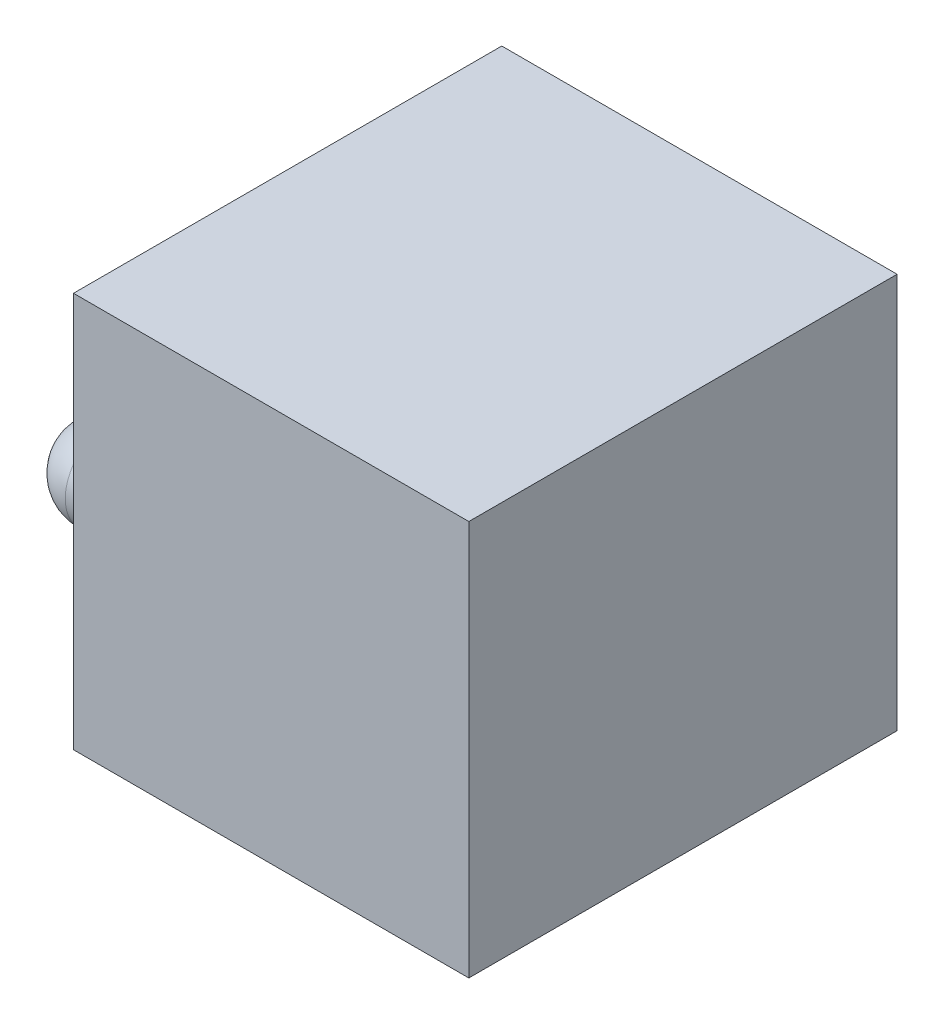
from build123d import *

# Parameters (mm, degrees)
SKETCH1_W            = 24
SKETCH1_H            = 26
BOSS_EXTRUDE1_DEPTH  = 24
SKETCH2_R            = 2.7
BOSS_EXTRUDE2_DEPTH  = 9
FILLET2_R            = 2.7
FILLET2_OF_MIRROR2_R = 2.7


with BuildPart() as part:
    # Sketch1 → Boss-Extrude1 (new body)
    with BuildSketch(Plane(origin=(0, 0, 0), x_dir=(1, 0, 0), z_dir=(0, 1, 0))):
        Rectangle(SKETCH1_W, SKETCH1_H)
    extrude(amount=BOSS_EXTRUDE1_DEPTH)

    # Sketch2 → Boss-Extrude2 (add)
    with BuildSketch(Plane.ZY.offset(12)):
        with Locations((-4.5, 7.148873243)):
            Circle(SKETCH2_R)
    boss_extrude2 = extrude(amount=BOSS_EXTRUDE2_DEPTH)

    # Fillet2
    fillet2_edges = [part.edges().sort_by_distance(p)[0] for p in [
        (-21, 7.148873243, -7.2),
    ]]
    fillet(fillet2_edges, radius=FILLET2_R)

    # Mirror2: Boss-Extrude2 across plane
    add(boss_extrude2.mirror(Plane.XY))

    # Fillet2 of Mirror2
    fillet2_of_mirror2_edges = [part.edges().sort_by_distance(p)[0] for p in [
        (-21, 7.148873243, 7.2),
    ]]
    fillet(fillet2_of_mirror2_edges, radius=FILLET2_OF_MIRROR2_R)


solid = part.part
